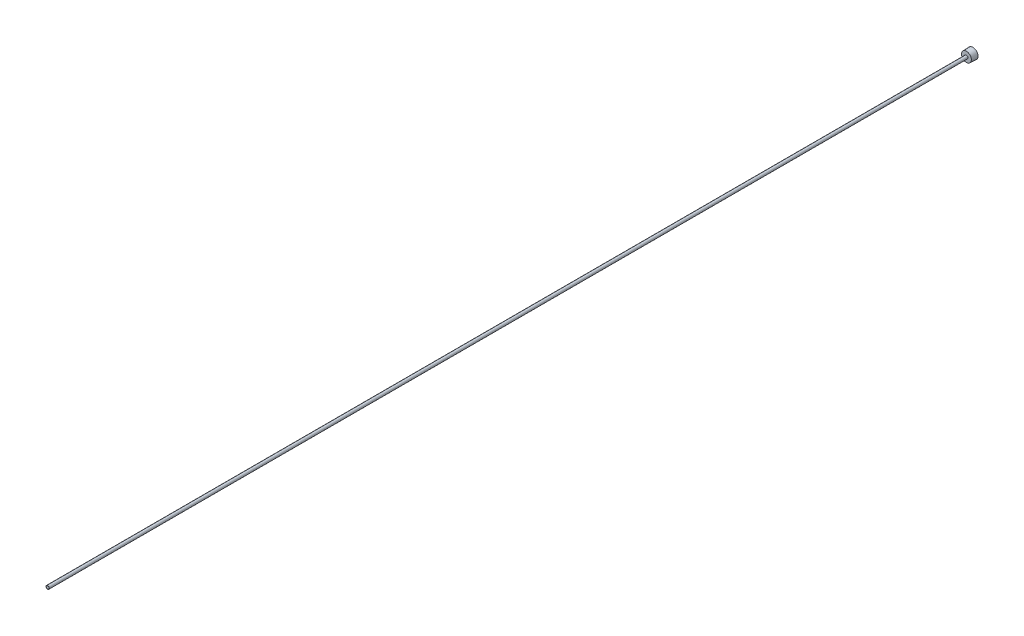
ISO-10303-21;
HEADER;
FILE_DESCRIPTION(('STEP AP214'),'2;1');
FILE_NAME('part.step','',(''),(''),'','','');
FILE_SCHEMA(('AUTOMOTIVE_DESIGN { 1 0 10303 214 1 1 1 1 }'));
ENDSEC;
DATA;
#1=APPLICATION_CONTEXT('core data for automotive mechanical design processes');
#2=APPLICATION_PROTOCOL_DEFINITION('international standard','automotive_design',2000,#1);
#3=PRODUCT_CONTEXT('',#1,'mechanical');
#4=PRODUCT('Part','Part','',(#3));
#5=PRODUCT_RELATED_PRODUCT_CATEGORY('part','',(#4));
#6=PRODUCT_DEFINITION_FORMATION('','',#4);
#7=PRODUCT_DEFINITION_CONTEXT('part definition',#1,'design');
#8=PRODUCT_DEFINITION('design','',#6,#7);
#9=PRODUCT_DEFINITION_SHAPE('','',#8);
#10=(LENGTH_UNIT() NAMED_UNIT(*) SI_UNIT(.MILLI.,.METRE.));
#11=(NAMED_UNIT(*) PLANE_ANGLE_UNIT() SI_UNIT($,.RADIAN.));
#12=(NAMED_UNIT(*) SI_UNIT($,.STERADIAN.) SOLID_ANGLE_UNIT());
#13=UNCERTAINTY_MEASURE_WITH_UNIT(LENGTH_MEASURE(1.E-05),#10,'distance_accuracy_value','');
#14=(GEOMETRIC_REPRESENTATION_CONTEXT(3) GLOBAL_UNCERTAINTY_ASSIGNED_CONTEXT((#13)) GLOBAL_UNIT_ASSIGNED_CONTEXT((#10,
#11,#12)) REPRESENTATION_CONTEXT('',''));
#15=CARTESIAN_POINT('',(0.,0.,0.));
#16=DIRECTION('',(0.,0.,1.));
#17=DIRECTION('',(1.,0.,0.));
#18=AXIS2_PLACEMENT_3D('',#15,#16,#17);
#19=CARTESIAN_POINT('',(0.,0.,0.));
#20=DIRECTION('',(0.,0.,1.));
#21=DIRECTION('',(1.,0.,0.));
#22=AXIS2_PLACEMENT_3D('',#19,#20,#21);
#23=CYLINDRICAL_SURFACE('',#22,1.3843);
#24=CARTESIAN_POINT('',(0.,0.,914.4));
#25=DIRECTION('',(0.,0.,1.));
#26=DIRECTION('',(1.,0.,0.));
#27=AXIS2_PLACEMENT_3D('',#24,#25,#26);
#28=CIRCLE('',#27,1.3843);
#29=CARTESIAN_POINT('',(1.3843,0.,914.4));
#30=VERTEX_POINT('',#29);
#31=EDGE_CURVE('E142',#30,#30,#28,.T.);
#32=ORIENTED_EDGE('',*,*,#31,.T.);
#33=EDGE_LOOP('',(#32));
#34=FACE_BOUND('',#33,.T.);
#35=CARTESIAN_POINT('',(0.,0.,4.7625));
#36=DIRECTION('',(0.,0.,-1.));
#37=DIRECTION('',(0.,1.,0.));
#38=AXIS2_PLACEMENT_3D('',#35,#36,#37);
#39=CIRCLE('',#38,1.3843);
#40=CARTESIAN_POINT('',(0.,1.38429999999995,4.7625));
#41=VERTEX_POINT('',#40);
#42=EDGE_CURVE('E37',#41,#41,#39,.F.);
#43=ORIENTED_EDGE('',*,*,#42,.F.);
#44=EDGE_LOOP('',(#43));
#45=FACE_BOUND('',#44,.T.);
#46=ADVANCED_FACE('F33',(#34,#45),#23,.F.);
#47=CARTESIAN_POINT('',(0.,0.,0.));
#48=DIRECTION('',(0.,0.,1.));
#49=DIRECTION('',(0.,-1.,0.));
#50=AXIS2_PLACEMENT_3D('',#47,#48,#49);
#51=PLANE('',#50);
#52=DIRECTION('',(0.,1.,0.));
#53=VECTOR('',#52,1.);
#54=CARTESIAN_POINT('',(-3.175,-1.83308710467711,0.));
#55=LINE('',#54,#53);
#56=CARTESIAN_POINT('',(-3.175,-1.83308710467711,0.));
#57=VERTEX_POINT('',#56);
#58=CARTESIAN_POINT('',(-3.175,1.83308710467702,0.));
#59=VERTEX_POINT('',#58);
#60=EDGE_CURVE('E124',#57,#59,#55,.T.);
#61=ORIENTED_EDGE('',*,*,#60,.F.);
#62=DIRECTION('',(-0.866025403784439,0.5,0.));
#63=VECTOR('',#62,1.);
#64=CARTESIAN_POINT('',(0.,-3.66617420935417,0.));
#65=LINE('',#64,#63);
#66=CARTESIAN_POINT('',(0.,-3.66617420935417,0.));
#67=VERTEX_POINT('',#66);
#68=EDGE_CURVE('E49',#67,#57,#65,.T.);
#69=ORIENTED_EDGE('',*,*,#68,.F.);
#70=DIRECTION('',(-0.866025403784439,-0.5,0.));
#71=VECTOR('',#70,1.);
#72=CARTESIAN_POINT('',(3.175,-1.83308710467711,0.));
#73=LINE('',#72,#71);
#74=CARTESIAN_POINT('',(3.175,-1.83308710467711,0.));
#75=VERTEX_POINT('',#74);
#76=EDGE_CURVE('E133',#75,#67,#73,.T.);
#77=ORIENTED_EDGE('',*,*,#76,.F.);
#78=DIRECTION('',(0.,-1.,0.));
#79=VECTOR('',#78,1.);
#80=CARTESIAN_POINT('',(3.175,1.83308710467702,0.));
#81=LINE('',#80,#79);
#82=CARTESIAN_POINT('',(3.175,1.83308710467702,0.));
#83=VERTEX_POINT('',#82);
#84=EDGE_CURVE('E131',#83,#75,#81,.T.);
#85=ORIENTED_EDGE('',*,*,#84,.F.);
#86=DIRECTION('',(0.866025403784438,-0.5,0.));
#87=VECTOR('',#86,1.);
#88=CARTESIAN_POINT('',(0.,3.66617420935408,0.));
#89=LINE('',#88,#87);
#90=CARTESIAN_POINT('',(0.,3.66617420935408,0.));
#91=VERTEX_POINT('',#90);
#92=EDGE_CURVE('E97',#91,#83,#89,.T.);
#93=ORIENTED_EDGE('',*,*,#92,.F.);
#94=DIRECTION('',(0.866025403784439,0.5,0.));
#95=VECTOR('',#94,1.);
#96=CARTESIAN_POINT('',(-3.175,1.83308710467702,0.));
#97=LINE('',#96,#95);
#98=EDGE_CURVE('E127',#59,#91,#97,.T.);
#99=ORIENTED_EDGE('',*,*,#98,.F.);
#100=EDGE_LOOP('',(#61,#69,#77,#85,#93,#99));
#101=FACE_BOUND('',#100,.T.);
#102=CARTESIAN_POINT('',(0.,0.,0.));
#103=DIRECTION('',(0.,0.,1.));
#104=DIRECTION('',(0.,-1.,0.));
#105=AXIS2_PLACEMENT_3D('',#102,#103,#104);
#106=CIRCLE('',#105,5.09270000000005);
#107=CARTESIAN_POINT('',(0.,-5.09270000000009,0.));
#108=VERTEX_POINT('',#107);
#109=EDGE_CURVE('E11',#108,#108,#106,.T.);
#110=ORIENTED_EDGE('',*,*,#109,.F.);
#111=EDGE_LOOP('',(#110));
#112=FACE_BOUND('',#111,.T.);
#113=ADVANCED_FACE('F35',(#101,#112),#51,.F.);
#114=CARTESIAN_POINT('',(0.,0.,0.));
#115=DIRECTION('',(0.,0.,-1.));
#116=DIRECTION('',(0.,1.,0.));
#117=AXIS2_PLACEMENT_3D('',#114,#115,#116);
#118=CONICAL_SURFACE('',#117,5.09270000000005,0.0364599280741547);
#119=CARTESIAN_POINT('',(0.,0.,6.35));
#120=DIRECTION('',(0.,0.,1.));
#121=DIRECTION('',(0.,-1.,0.));
#122=AXIS2_PLACEMENT_3D('',#119,#120,#121);
#123=CIRCLE('',#122,4.86107681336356);
#124=CARTESIAN_POINT('',(0.,-4.86107681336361,6.35));
#125=VERTEX_POINT('',#124);
#126=EDGE_CURVE('E42',#125,#125,#123,.T.);
#127=ORIENTED_EDGE('',*,*,#126,.F.);
#128=EDGE_LOOP('',(#127));
#129=FACE_BOUND('',#128,.T.);
#130=ORIENTED_EDGE('',*,*,#109,.T.);
#131=EDGE_LOOP('',(#130));
#132=FACE_BOUND('',#131,.T.);
#133=ADVANCED_FACE('F156',(#129,#132),#118,.T.);
#134=CARTESIAN_POINT('',(0.,4.86107681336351,6.35));
#135=DIRECTION('',(0.,0.,-1.));
#136=DIRECTION('',(0.,1.,0.));
#137=AXIS2_PLACEMENT_3D('',#134,#135,#136);
#138=PLANE('',#137);
#139=CARTESIAN_POINT('',(0.,0.,6.35));
#140=DIRECTION('',(0.,0.,1.));
#141=DIRECTION('',(0.,-1.,0.));
#142=AXIS2_PLACEMENT_3D('',#139,#140,#141);
#143=CIRCLE('',#142,1.58750000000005);
#144=CARTESIAN_POINT('',(0.,-1.58750000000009,6.35));
#145=VERTEX_POINT('',#144);
#146=EDGE_CURVE('E148',#145,#145,#143,.T.);
#147=ORIENTED_EDGE('',*,*,#146,.F.);
#148=EDGE_LOOP('',(#147));
#149=FACE_BOUND('',#148,.T.);
#150=ORIENTED_EDGE('',*,*,#126,.T.);
#151=EDGE_LOOP('',(#150));
#152=FACE_BOUND('',#151,.T.);
#153=ADVANCED_FACE('F154',(#149,#152),#138,.F.);
#154=CARTESIAN_POINT('',(0.,0.,0.));
#155=DIRECTION('',(0.,0.,1.));
#156=DIRECTION('',(0.,-1.,0.));
#157=AXIS2_PLACEMENT_3D('',#154,#155,#156);
#158=CYLINDRICAL_SURFACE('',#157,1.58749999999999);
#159=CARTESIAN_POINT('',(0.,0.,914.4));
#160=DIRECTION('',(0.,0.,1.));
#161=DIRECTION('',(0.,-1.,0.));
#162=AXIS2_PLACEMENT_3D('',#159,#160,#161);
#163=CIRCLE('',#162,1.58749999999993);
#164=CARTESIAN_POINT('',(0.,-1.58749999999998,914.4));
#165=VERTEX_POINT('',#164);
#166=EDGE_CURVE('E145',#165,#165,#163,.T.);
#167=ORIENTED_EDGE('',*,*,#166,.F.);
#168=EDGE_LOOP('',(#167));
#169=FACE_BOUND('',#168,.T.);
#170=ORIENTED_EDGE('',*,*,#146,.T.);
#171=EDGE_LOOP('',(#170));
#172=FACE_BOUND('',#171,.T.);
#173=ADVANCED_FACE('F190',(#169,#172),#158,.T.);
#174=CARTESIAN_POINT('',(0.,1.58749999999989,914.4));
#175=DIRECTION('',(0.,0.,-1.));
#176=DIRECTION('',(0.,1.,0.));
#177=AXIS2_PLACEMENT_3D('',#174,#175,#176);
#178=PLANE('',#177);
#179=ORIENTED_EDGE('',*,*,#31,.F.);
#180=EDGE_LOOP('',(#179));
#181=FACE_BOUND('',#180,.T.);
#182=ORIENTED_EDGE('',*,*,#166,.T.);
#183=EDGE_LOOP('',(#182));
#184=FACE_BOUND('',#183,.T.);
#185=ADVANCED_FACE('F183',(#181,#184),#178,.F.);
#186=CARTESIAN_POINT('',(-3.175,-1.83308710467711,4.7625));
#187=DIRECTION('',(0.,0.,-1.));
#188=DIRECTION('',(0.,1.,0.));
#189=AXIS2_PLACEMENT_3D('',#186,#187,#188);
#190=PLANE('',#189);
#191=DIRECTION('',(-0.866025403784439,0.5,0.));
#192=VECTOR('',#191,1.);
#193=CARTESIAN_POINT('',(0.,-3.66617420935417,4.7625));
#194=LINE('',#193,#192);
#195=CARTESIAN_POINT('',(0.,-3.66617420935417,4.7625));
#196=VERTEX_POINT('',#195);
#197=CARTESIAN_POINT('',(-3.175,-1.83308710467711,4.7625));
#198=VERTEX_POINT('',#197);
#199=EDGE_CURVE('E135',#196,#198,#194,.T.);
#200=ORIENTED_EDGE('',*,*,#199,.T.);
#201=DIRECTION('',(0.,1.,0.));
#202=VECTOR('',#201,1.);
#203=CARTESIAN_POINT('',(-3.175,-1.83308710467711,4.7625));
#204=LINE('',#203,#202);
#205=CARTESIAN_POINT('',(-3.175,1.83308710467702,4.7625));
#206=VERTEX_POINT('',#205);
#207=EDGE_CURVE('E118',#198,#206,#204,.T.);
#208=ORIENTED_EDGE('',*,*,#207,.T.);
#209=DIRECTION('',(0.866025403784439,0.5,0.));
#210=VECTOR('',#209,1.);
#211=CARTESIAN_POINT('',(-3.175,1.83308710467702,4.7625));
#212=LINE('',#211,#210);
#213=CARTESIAN_POINT('',(0.,3.66617420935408,4.7625));
#214=VERTEX_POINT('',#213);
#215=EDGE_CURVE('E116',#206,#214,#212,.T.);
#216=ORIENTED_EDGE('',*,*,#215,.T.);
#217=DIRECTION('',(0.866025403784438,-0.5,0.));
#218=VECTOR('',#217,1.);
#219=CARTESIAN_POINT('',(0.,3.66617420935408,4.7625));
#220=LINE('',#219,#218);
#221=CARTESIAN_POINT('',(3.175,1.83308710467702,4.7625));
#222=VERTEX_POINT('',#221);
#223=EDGE_CURVE('E94',#214,#222,#220,.T.);
#224=ORIENTED_EDGE('',*,*,#223,.T.);
#225=DIRECTION('',(0.,-1.,0.));
#226=VECTOR('',#225,1.);
#227=CARTESIAN_POINT('',(3.175,1.83308710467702,4.7625));
#228=LINE('',#227,#226);
#229=CARTESIAN_POINT('',(3.175,-1.83308710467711,4.7625));
#230=VERTEX_POINT('',#229);
#231=EDGE_CURVE('E105',#222,#230,#228,.T.);
#232=ORIENTED_EDGE('',*,*,#231,.T.);
#233=DIRECTION('',(-0.866025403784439,-0.5,0.));
#234=VECTOR('',#233,1.);
#235=CARTESIAN_POINT('',(3.175,-1.83308710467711,4.7625));
#236=LINE('',#235,#234);
#237=EDGE_CURVE('E109',#230,#196,#236,.T.);
#238=ORIENTED_EDGE('',*,*,#237,.T.);
#239=EDGE_LOOP('',(#200,#208,#216,#224,#232,#238));
#240=FACE_BOUND('',#239,.T.);
#241=ORIENTED_EDGE('',*,*,#42,.T.);
#242=EDGE_LOOP('',(#241));
#243=FACE_BOUND('',#242,.T.);
#244=ADVANCED_FACE('F112',(#240,#243),#190,.T.);
#245=CARTESIAN_POINT('',(0.,-3.66617420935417,4.7625));
#246=DIRECTION('',(-0.5,-0.866025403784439,0.));
#247=DIRECTION('',(0.866025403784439,-0.5,0.));
#248=AXIS2_PLACEMENT_3D('',#245,#246,#247);
#249=PLANE('',#248);
#250=ORIENTED_EDGE('',*,*,#68,.T.);
#251=DIRECTION('',(0.,0.,-1.));
#252=VECTOR('',#251,1.);
#253=CARTESIAN_POINT('',(-3.175,-1.83308710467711,4.7625));
#254=LINE('',#253,#252);
#255=EDGE_CURVE('E79',#198,#57,#254,.T.);
#256=ORIENTED_EDGE('',*,*,#255,.F.);
#257=ORIENTED_EDGE('',*,*,#199,.F.);
#258=DIRECTION('',(0.,0.,-1.));
#259=VECTOR('',#258,1.);
#260=CARTESIAN_POINT('',(0.,-3.66617420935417,4.7625));
#261=LINE('',#260,#259);
#262=EDGE_CURVE('E57',#196,#67,#261,.T.);
#263=ORIENTED_EDGE('',*,*,#262,.T.);
#264=EDGE_LOOP('',(#250,#256,#257,#263));
#265=FACE_BOUND('',#264,.T.);
#266=ADVANCED_FACE('F174',(#265),#249,.F.);
#267=CARTESIAN_POINT('',(3.175,-1.83308710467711,4.7625));
#268=DIRECTION('',(0.5,-0.866025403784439,0.));
#269=DIRECTION('',(0.866025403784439,0.5,0.));
#270=AXIS2_PLACEMENT_3D('',#267,#268,#269);
#271=PLANE('',#270);
#272=ORIENTED_EDGE('',*,*,#76,.T.);
#273=ORIENTED_EDGE('',*,*,#262,.F.);
#274=ORIENTED_EDGE('',*,*,#237,.F.);
#275=DIRECTION('',(0.,0.,-1.));
#276=VECTOR('',#275,1.);
#277=CARTESIAN_POINT('',(3.175,-1.83308710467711,4.7625));
#278=LINE('',#277,#276);
#279=EDGE_CURVE('E101',#230,#75,#278,.T.);
#280=ORIENTED_EDGE('',*,*,#279,.T.);
#281=EDGE_LOOP('',(#272,#273,#274,#280));
#282=FACE_BOUND('',#281,.T.);
#283=ADVANCED_FACE('F176',(#282),#271,.F.);
#284=CARTESIAN_POINT('',(3.175,1.83308710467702,4.7625));
#285=DIRECTION('',(1.,0.,0.));
#286=DIRECTION('',(0.,1.,0.));
#287=AXIS2_PLACEMENT_3D('',#284,#285,#286);
#288=PLANE('',#287);
#289=ORIENTED_EDGE('',*,*,#84,.T.);
#290=ORIENTED_EDGE('',*,*,#279,.F.);
#291=ORIENTED_EDGE('',*,*,#231,.F.);
#292=DIRECTION('',(0.,0.,-1.));
#293=VECTOR('',#292,1.);
#294=CARTESIAN_POINT('',(3.175,1.83308710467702,4.7625));
#295=LINE('',#294,#293);
#296=EDGE_CURVE('E90',#222,#83,#295,.T.);
#297=ORIENTED_EDGE('',*,*,#296,.T.);
#298=EDGE_LOOP('',(#289,#290,#291,#297));
#299=FACE_BOUND('',#298,.T.);
#300=ADVANCED_FACE('F106',(#299),#288,.F.);
#301=CARTESIAN_POINT('',(0.,3.66617420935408,4.7625));
#302=DIRECTION('',(0.5,0.866025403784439,0.));
#303=DIRECTION('',(-0.866025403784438,0.5,0.));
#304=AXIS2_PLACEMENT_3D('',#301,#302,#303);
#305=PLANE('',#304);
#306=ORIENTED_EDGE('',*,*,#92,.T.);
#307=ORIENTED_EDGE('',*,*,#296,.F.);
#308=ORIENTED_EDGE('',*,*,#223,.F.);
#309=DIRECTION('',(0.,0.,-1.));
#310=VECTOR('',#309,1.);
#311=CARTESIAN_POINT('',(0.,3.66617420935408,4.7625));
#312=LINE('',#311,#310);
#313=EDGE_CURVE('E102',#214,#91,#312,.T.);
#314=ORIENTED_EDGE('',*,*,#313,.T.);
#315=EDGE_LOOP('',(#306,#307,#308,#314));
#316=FACE_BOUND('',#315,.T.);
#317=ADVANCED_FACE('F92',(#316),#305,.F.);
#318=CARTESIAN_POINT('',(-3.175,1.83308710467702,4.7625));
#319=DIRECTION('',(-0.5,0.866025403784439,0.));
#320=DIRECTION('',(-0.866025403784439,-0.5,0.));
#321=AXIS2_PLACEMENT_3D('',#318,#319,#320);
#322=PLANE('',#321);
#323=ORIENTED_EDGE('',*,*,#98,.T.);
#324=ORIENTED_EDGE('',*,*,#313,.F.);
#325=ORIENTED_EDGE('',*,*,#215,.F.);
#326=DIRECTION('',(0.,0.,-1.));
#327=VECTOR('',#326,1.);
#328=CARTESIAN_POINT('',(-3.175,1.83308710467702,4.7625));
#329=LINE('',#328,#327);
#330=EDGE_CURVE('E139',#206,#59,#329,.T.);
#331=ORIENTED_EDGE('',*,*,#330,.T.);
#332=EDGE_LOOP('',(#323,#324,#325,#331));
#333=FACE_BOUND('',#332,.T.);
#334=ADVANCED_FACE('F246',(#333),#322,.F.);
#335=CARTESIAN_POINT('',(-3.175,-1.83308710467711,4.7625));
#336=DIRECTION('',(-1.,0.,0.));
#337=DIRECTION('',(0.,0.,1.));
#338=AXIS2_PLACEMENT_3D('',#335,#336,#337);
#339=PLANE('',#338);
#340=ORIENTED_EDGE('',*,*,#60,.T.);
#341=ORIENTED_EDGE('',*,*,#330,.F.);
#342=ORIENTED_EDGE('',*,*,#207,.F.);
#343=ORIENTED_EDGE('',*,*,#255,.T.);
#344=EDGE_LOOP('',(#340,#341,#342,#343));
#345=FACE_BOUND('',#344,.T.);
#346=ADVANCED_FACE('F172',(#345),#339,.F.);
#347=CLOSED_SHELL('',(#46,#113,#133,#153,#173,#185,#244,#266,#283,#300,#317,#334,#346));
#348=MANIFOLD_SOLID_BREP('B2',#347);
#349=ADVANCED_BREP_SHAPE_REPRESENTATION('',(#18,#348),#14);
#350=SHAPE_DEFINITION_REPRESENTATION(#9,#349);
ENDSEC;
END-ISO-10303-21;
